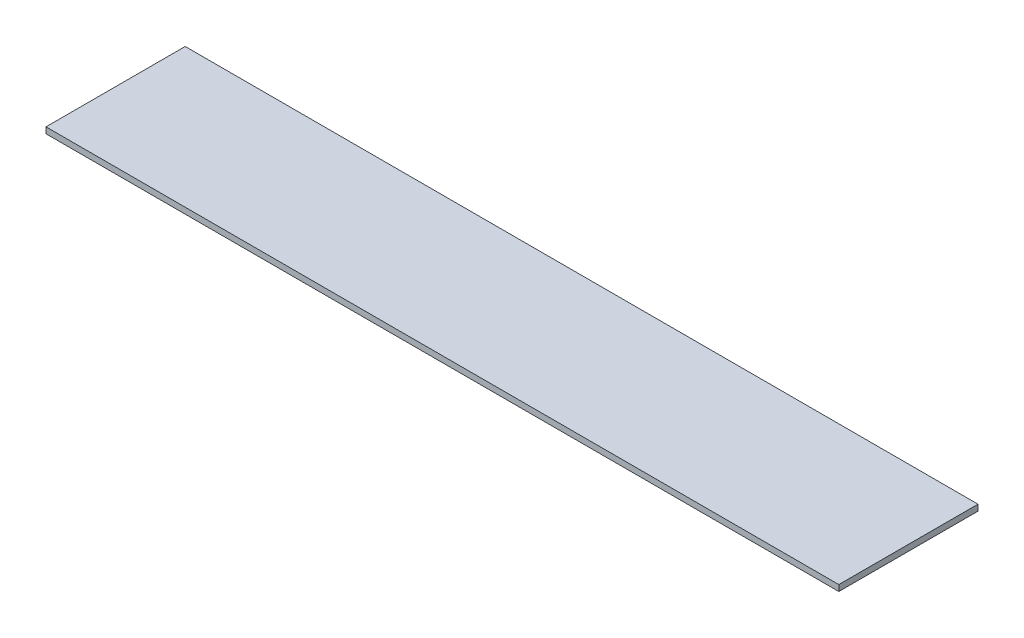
ISO-10303-21;
HEADER;
FILE_DESCRIPTION(('STEP AP214'),'2;1');
FILE_NAME('part.step','',(''),(''),'','','');
FILE_SCHEMA(('AUTOMOTIVE_DESIGN { 1 0 10303 214 1 1 1 1 }'));
ENDSEC;
DATA;
#1=APPLICATION_CONTEXT('core data for automotive mechanical design processes');
#2=APPLICATION_PROTOCOL_DEFINITION('international standard','automotive_design',2000,#1);
#3=PRODUCT_CONTEXT('',#1,'mechanical');
#4=PRODUCT('Part','Part','',(#3));
#5=PRODUCT_RELATED_PRODUCT_CATEGORY('part','',(#4));
#6=PRODUCT_DEFINITION_FORMATION('','',#4);
#7=PRODUCT_DEFINITION_CONTEXT('part definition',#1,'design');
#8=PRODUCT_DEFINITION('design','',#6,#7);
#9=PRODUCT_DEFINITION_SHAPE('','',#8);
#10=(LENGTH_UNIT() NAMED_UNIT(*) SI_UNIT(.MILLI.,.METRE.));
#11=(NAMED_UNIT(*) PLANE_ANGLE_UNIT() SI_UNIT($,.RADIAN.));
#12=(NAMED_UNIT(*) SI_UNIT($,.STERADIAN.) SOLID_ANGLE_UNIT());
#13=UNCERTAINTY_MEASURE_WITH_UNIT(LENGTH_MEASURE(1.E-05),#10,'distance_accuracy_value','');
#14=(GEOMETRIC_REPRESENTATION_CONTEXT(3) GLOBAL_UNCERTAINTY_ASSIGNED_CONTEXT((#13)) GLOBAL_UNIT_ASSIGNED_CONTEXT((#10,
#11,#12)) REPRESENTATION_CONTEXT('',''));
#15=CARTESIAN_POINT('',(0.,0.,0.));
#16=DIRECTION('',(0.,0.,1.));
#17=DIRECTION('',(1.,0.,0.));
#18=AXIS2_PLACEMENT_3D('',#15,#16,#17);
#19=CARTESIAN_POINT('',(831.85,12.7,146.05));
#20=DIRECTION('',(-1.,0.,0.));
#21=DIRECTION('',(0.,0.,1.));
#22=AXIS2_PLACEMENT_3D('',#19,#20,#21);
#23=PLANE('',#22);
#24=DIRECTION('',(0.,0.,-1.));
#25=VECTOR('',#24,1.);
#26=CARTESIAN_POINT('',(831.85,0.,146.05));
#27=LINE('',#26,#25);
#28=CARTESIAN_POINT('',(831.85,0.,146.05));
#29=VERTEX_POINT('',#28);
#30=CARTESIAN_POINT('',(831.85,0.,-146.05));
#31=VERTEX_POINT('',#30);
#32=EDGE_CURVE('E96',#29,#31,#27,.T.);
#33=ORIENTED_EDGE('',*,*,#32,.T.);
#34=DIRECTION('',(0.,-1.,0.));
#35=VECTOR('',#34,1.);
#36=CARTESIAN_POINT('',(831.85,12.7,-146.05));
#37=LINE('',#36,#35);
#38=CARTESIAN_POINT('',(831.85,12.7,-146.05));
#39=VERTEX_POINT('',#38);
#40=EDGE_CURVE('E11',#39,#31,#37,.T.);
#41=ORIENTED_EDGE('',*,*,#40,.F.);
#42=DIRECTION('',(0.,0.,-1.));
#43=VECTOR('',#42,1.);
#44=CARTESIAN_POINT('',(831.85,12.7,146.05));
#45=LINE('',#44,#43);
#46=CARTESIAN_POINT('',(831.85,12.7,146.05));
#47=VERTEX_POINT('',#46);
#48=EDGE_CURVE('E84',#47,#39,#45,.T.);
#49=ORIENTED_EDGE('',*,*,#48,.F.);
#50=DIRECTION('',(0.,-1.,0.));
#51=VECTOR('',#50,1.);
#52=CARTESIAN_POINT('',(831.85,12.7,146.05));
#53=LINE('',#52,#51);
#54=EDGE_CURVE('E92',#47,#29,#53,.T.);
#55=ORIENTED_EDGE('',*,*,#54,.T.);
#56=EDGE_LOOP('',(#33,#41,#49,#55));
#57=FACE_BOUND('',#56,.T.);
#58=ADVANCED_FACE('F33',(#57),#23,.F.);
#59=CARTESIAN_POINT('',(-831.85,12.7,-146.05));
#60=DIRECTION('',(0.,0.,1.));
#61=DIRECTION('',(1.,0.,0.));
#62=AXIS2_PLACEMENT_3D('',#59,#60,#61);
#63=PLANE('',#62);
#64=DIRECTION('',(-1.,0.,0.));
#65=VECTOR('',#64,1.);
#66=CARTESIAN_POINT('',(-831.85,0.,-146.05));
#67=LINE('',#66,#65);
#68=CARTESIAN_POINT('',(-831.85,0.,-146.05));
#69=VERTEX_POINT('',#68);
#70=EDGE_CURVE('E88',#31,#69,#67,.T.);
#71=ORIENTED_EDGE('',*,*,#70,.T.);
#72=DIRECTION('',(0.,-1.,0.));
#73=VECTOR('',#72,1.);
#74=CARTESIAN_POINT('',(-831.85,12.7,-146.05));
#75=LINE('',#74,#73);
#76=CARTESIAN_POINT('',(-831.85,12.7,-146.05));
#77=VERTEX_POINT('',#76);
#78=EDGE_CURVE('E41',#77,#69,#75,.T.);
#79=ORIENTED_EDGE('',*,*,#78,.F.);
#80=DIRECTION('',(-1.,0.,0.));
#81=VECTOR('',#80,1.);
#82=CARTESIAN_POINT('',(-831.85,12.7,-146.05));
#83=LINE('',#82,#81);
#84=EDGE_CURVE('E79',#39,#77,#83,.T.);
#85=ORIENTED_EDGE('',*,*,#84,.F.);
#86=ORIENTED_EDGE('',*,*,#40,.T.);
#87=EDGE_LOOP('',(#71,#79,#85,#86));
#88=FACE_BOUND('',#87,.T.);
#89=ADVANCED_FACE('F87',(#88),#63,.F.);
#90=CARTESIAN_POINT('',(-831.85,12.7,146.05));
#91=DIRECTION('',(1.,0.,0.));
#92=DIRECTION('',(0.,0.,-1.));
#93=AXIS2_PLACEMENT_3D('',#90,#91,#92);
#94=PLANE('',#93);
#95=DIRECTION('',(0.,0.,1.));
#96=VECTOR('',#95,1.);
#97=CARTESIAN_POINT('',(-831.85,0.,146.05));
#98=LINE('',#97,#96);
#99=CARTESIAN_POINT('',(-831.85,0.,146.05));
#100=VERTEX_POINT('',#99);
#101=EDGE_CURVE('E66',#69,#100,#98,.T.);
#102=ORIENTED_EDGE('',*,*,#101,.T.);
#103=DIRECTION('',(0.,-1.,0.));
#104=VECTOR('',#103,1.);
#105=CARTESIAN_POINT('',(-831.85,12.7,146.05));
#106=LINE('',#105,#104);
#107=CARTESIAN_POINT('',(-831.85,12.7,146.05));
#108=VERTEX_POINT('',#107);
#109=EDGE_CURVE('E89',#108,#100,#106,.T.);
#110=ORIENTED_EDGE('',*,*,#109,.F.);
#111=DIRECTION('',(0.,0.,1.));
#112=VECTOR('',#111,1.);
#113=CARTESIAN_POINT('',(-831.85,12.7,146.05));
#114=LINE('',#113,#112);
#115=EDGE_CURVE('E82',#77,#108,#114,.T.);
#116=ORIENTED_EDGE('',*,*,#115,.F.);
#117=ORIENTED_EDGE('',*,*,#78,.T.);
#118=EDGE_LOOP('',(#102,#110,#116,#117));
#119=FACE_BOUND('',#118,.T.);
#120=ADVANCED_FACE('F90',(#119),#94,.F.);
#121=CARTESIAN_POINT('',(-831.85,12.7,146.05));
#122=DIRECTION('',(0.,0.,-1.));
#123=DIRECTION('',(-1.,0.,0.));
#124=AXIS2_PLACEMENT_3D('',#121,#122,#123);
#125=PLANE('',#124);
#126=DIRECTION('',(1.,0.,0.));
#127=VECTOR('',#126,1.);
#128=CARTESIAN_POINT('',(-831.85,0.,146.05));
#129=LINE('',#128,#127);
#130=EDGE_CURVE('E72',#100,#29,#129,.T.);
#131=ORIENTED_EDGE('',*,*,#130,.T.);
#132=ORIENTED_EDGE('',*,*,#54,.F.);
#133=DIRECTION('',(1.,0.,0.));
#134=VECTOR('',#133,1.);
#135=CARTESIAN_POINT('',(-831.85,12.7,146.05));
#136=LINE('',#135,#134);
#137=EDGE_CURVE('E49',#108,#47,#136,.T.);
#138=ORIENTED_EDGE('',*,*,#137,.F.);
#139=ORIENTED_EDGE('',*,*,#109,.T.);
#140=EDGE_LOOP('',(#131,#132,#138,#139));
#141=FACE_BOUND('',#140,.T.);
#142=ADVANCED_FACE('F103',(#141),#125,.F.);
#143=CARTESIAN_POINT('',(0.,12.7,0.));
#144=DIRECTION('',(0.,-1.,0.));
#145=DIRECTION('',(0.,0.,-1.));
#146=AXIS2_PLACEMENT_3D('',#143,#144,#145);
#147=PLANE('',#146);
#148=ORIENTED_EDGE('',*,*,#48,.T.);
#149=ORIENTED_EDGE('',*,*,#84,.T.);
#150=ORIENTED_EDGE('',*,*,#115,.T.);
#151=ORIENTED_EDGE('',*,*,#137,.T.);
#152=EDGE_LOOP('',(#148,#149,#150,#151));
#153=FACE_BOUND('',#152,.T.);
#154=ADVANCED_FACE('F80',(#153),#147,.F.);
#155=CARTESIAN_POINT('',(0.,0.,0.));
#156=DIRECTION('',(0.,-1.,0.));
#157=DIRECTION('',(0.,0.,-1.));
#158=AXIS2_PLACEMENT_3D('',#155,#156,#157);
#159=PLANE('',#158);
#160=ORIENTED_EDGE('',*,*,#32,.F.);
#161=ORIENTED_EDGE('',*,*,#130,.F.);
#162=ORIENTED_EDGE('',*,*,#101,.F.);
#163=ORIENTED_EDGE('',*,*,#70,.F.);
#164=EDGE_LOOP('',(#160,#161,#162,#163));
#165=FACE_BOUND('',#164,.T.);
#166=ADVANCED_FACE('F106',(#165),#159,.T.);
#167=CLOSED_SHELL('',(#58,#89,#120,#142,#154,#166));
#168=MANIFOLD_SOLID_BREP('B2',#167);
#169=ADVANCED_BREP_SHAPE_REPRESENTATION('',(#18,#168),#14);
#170=SHAPE_DEFINITION_REPRESENTATION(#9,#169);
ENDSEC;
END-ISO-10303-21;
